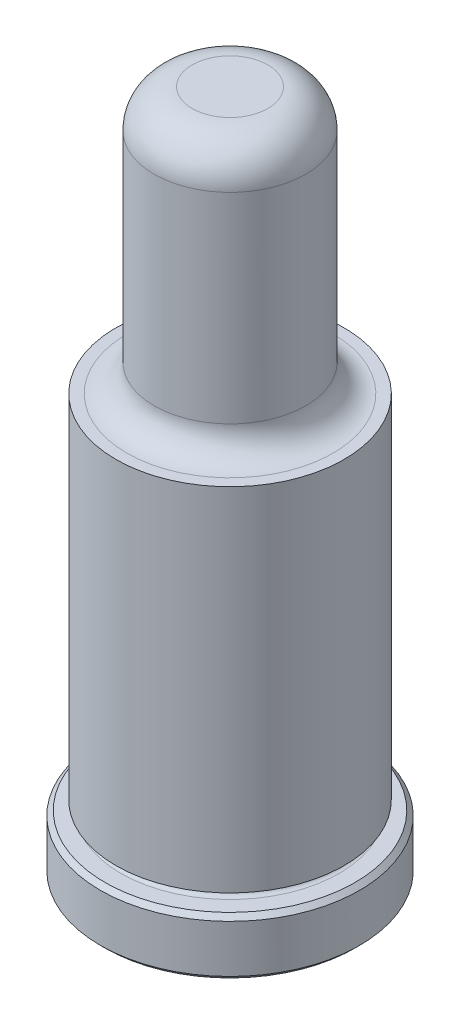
ISO-10303-21;
HEADER;
FILE_DESCRIPTION(('STEP AP214'),'2;1');
FILE_NAME('part.step','',(''),(''),'','','');
FILE_SCHEMA(('AUTOMOTIVE_DESIGN { 1 0 10303 214 1 1 1 1 }'));
ENDSEC;
DATA;
#1=APPLICATION_CONTEXT('core data for automotive mechanical design processes');
#2=APPLICATION_PROTOCOL_DEFINITION('international standard','automotive_design',2000,#1);
#3=PRODUCT_CONTEXT('',#1,'mechanical');
#4=PRODUCT('Part','Part','',(#3));
#5=PRODUCT_RELATED_PRODUCT_CATEGORY('part','',(#4));
#6=PRODUCT_DEFINITION_FORMATION('','',#4);
#7=PRODUCT_DEFINITION_CONTEXT('part definition',#1,'design');
#8=PRODUCT_DEFINITION('design','',#6,#7);
#9=PRODUCT_DEFINITION_SHAPE('','',#8);
#10=(LENGTH_UNIT() NAMED_UNIT(*) SI_UNIT(.MILLI.,.METRE.));
#11=(NAMED_UNIT(*) PLANE_ANGLE_UNIT() SI_UNIT($,.RADIAN.));
#12=(NAMED_UNIT(*) SI_UNIT($,.STERADIAN.) SOLID_ANGLE_UNIT());
#13=UNCERTAINTY_MEASURE_WITH_UNIT(LENGTH_MEASURE(1.E-05),#10,'distance_accuracy_value','');
#14=(GEOMETRIC_REPRESENTATION_CONTEXT(3) GLOBAL_UNCERTAINTY_ASSIGNED_CONTEXT((#13)) GLOBAL_UNIT_ASSIGNED_CONTEXT((#10,
#11,#12)) REPRESENTATION_CONTEXT('',''));
#15=CARTESIAN_POINT('',(0.,0.,0.));
#16=DIRECTION('',(0.,0.,1.));
#17=DIRECTION('',(1.,0.,0.));
#18=AXIS2_PLACEMENT_3D('',#15,#16,#17);
#19=CARTESIAN_POINT('',(0.,0.,0.));
#20=DIRECTION('',(0.,1.,0.));
#21=DIRECTION('',(0.,0.,1.));
#22=AXIS2_PLACEMENT_3D('',#19,#20,#21);
#23=PLANE('',#22);
#24=CARTESIAN_POINT('',(0.,0.,0.));
#25=DIRECTION('',(0.,1.,0.));
#26=DIRECTION('',(0.,0.,1.));
#27=AXIS2_PLACEMENT_3D('',#24,#25,#26);
#28=CIRCLE('',#27,10.4521);
#29=CARTESIAN_POINT('',(0.,0.,10.4521));
#30=VERTEX_POINT('',#29);
#31=EDGE_CURVE('E46',#30,#30,#28,.F.);
#32=ORIENTED_EDGE('',*,*,#31,.T.);
#33=EDGE_LOOP('',(#32));
#34=FACE_BOUND('',#33,.T.);
#35=ADVANCED_FACE('F31',(#34),#23,.F.);
#36=CARTESIAN_POINT('',(0.,0.,0.));
#37=DIRECTION('',(0.,1.,0.));
#38=DIRECTION('',(0.,0.,1.));
#39=AXIS2_PLACEMENT_3D('',#36,#37,#38);
#40=CYLINDRICAL_SURFACE('',#39,10.8331);
#41=CARTESIAN_POINT('',(0.,0.381000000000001,0.));
#42=DIRECTION('',(0.,1.,0.));
#43=DIRECTION('',(0.,0.,1.));
#44=AXIS2_PLACEMENT_3D('',#41,#42,#43);
#45=CIRCLE('',#44,10.8331);
#46=CARTESIAN_POINT('',(0.,0.380999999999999,10.8331));
#47=VERTEX_POINT('',#46);
#48=EDGE_CURVE('E51',#47,#47,#45,.T.);
#49=ORIENTED_EDGE('',*,*,#48,.T.);
#50=EDGE_LOOP('',(#49));
#51=FACE_BOUND('',#50,.T.);
#52=CARTESIAN_POINT('',(0.,4.3688,0.));
#53=DIRECTION('',(0.,-1.,0.));
#54=DIRECTION('',(0.,0.,-1.));
#55=AXIS2_PLACEMENT_3D('',#52,#53,#54);
#56=CIRCLE('',#55,10.8331);
#57=CARTESIAN_POINT('',(0.,4.36880000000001,-10.8331));
#58=VERTEX_POINT('',#57);
#59=EDGE_CURVE('E54',#58,#58,#56,.T.);
#60=ORIENTED_EDGE('',*,*,#59,.T.);
#61=EDGE_LOOP('',(#60));
#62=FACE_BOUND('',#61,.T.);
#63=ADVANCED_FACE('F110',(#51,#62),#40,.T.);
#64=CARTESIAN_POINT('',(0.,4.7498,-10.8331));
#65=DIRECTION('',(0.,-1.,0.));
#66=DIRECTION('',(0.,0.,-1.));
#67=AXIS2_PLACEMENT_3D('',#64,#65,#66);
#68=PLANE('',#67);
#69=CARTESIAN_POINT('',(0.,4.7498,0.));
#70=DIRECTION('',(0.,-1.,0.));
#71=DIRECTION('',(0.,0.,-1.));
#72=AXIS2_PLACEMENT_3D('',#69,#70,#71);
#73=CIRCLE('',#72,10.4521);
#74=CARTESIAN_POINT('',(0.,4.7498,-10.4521));
#75=VERTEX_POINT('',#74);
#76=EDGE_CURVE('E42',#75,#75,#73,.F.);
#77=ORIENTED_EDGE('',*,*,#76,.T.);
#78=EDGE_LOOP('',(#77));
#79=FACE_BOUND('',#78,.T.);
#80=CARTESIAN_POINT('',(0.,4.7498,0.));
#81=DIRECTION('',(0.,1.,0.));
#82=DIRECTION('',(0.,0.,1.));
#83=AXIS2_PLACEMENT_3D('',#80,#81,#82);
#84=CIRCLE('',#83,9.13129999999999);
#85=CARTESIAN_POINT('',(0.,4.7498,9.13129999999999));
#86=VERTEX_POINT('',#85);
#87=EDGE_CURVE('E57',#86,#86,#84,.T.);
#88=ORIENTED_EDGE('',*,*,#87,.F.);
#89=EDGE_LOOP('',(#88));
#90=FACE_BOUND('',#89,.T.);
#91=ADVANCED_FACE('F105',(#79,#90),#68,.F.);
#92=CARTESIAN_POINT('',(0.,5.1308,0.));
#93=DIRECTION('',(0.,1.,0.));
#94=DIRECTION('',(0.,0.,1.));
#95=AXIS2_PLACEMENT_3D('',#92,#93,#94);
#96=TOROIDAL_SURFACE('',#95,9.13129999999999,0.381);
#97=CARTESIAN_POINT('',(0.,5.5118,0.));
#98=DIRECTION('',(0.,1.,0.));
#99=DIRECTION('',(0.,0.,1.));
#100=AXIS2_PLACEMENT_3D('',#97,#98,#99);
#101=CIRCLE('',#100,9.13129999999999);
#102=CARTESIAN_POINT('',(0.,5.5118,9.13129999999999));
#103=VERTEX_POINT('',#102);
#104=EDGE_CURVE('E60',#103,#103,#101,.T.);
#105=ORIENTED_EDGE('',*,*,#104,.F.);
#106=EDGE_LOOP('',(#105));
#107=FACE_BOUND('',#106,.T.);
#108=ORIENTED_EDGE('',*,*,#87,.T.);
#109=EDGE_LOOP('',(#108));
#110=FACE_BOUND('',#109,.T.);
#111=ADVANCED_FACE('F99',(#107,#110),#96,.F.);
#112=CARTESIAN_POINT('',(0.,5.5118,-9.13129999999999));
#113=DIRECTION('',(0.,1.,0.));
#114=DIRECTION('',(0.,0.,1.));
#115=AXIS2_PLACEMENT_3D('',#112,#113,#114);
#116=PLANE('',#115);
#117=CARTESIAN_POINT('',(0.,5.5118,0.));
#118=DIRECTION('',(0.,1.,0.));
#119=DIRECTION('',(0.,0.,1.));
#120=AXIS2_PLACEMENT_3D('',#117,#118,#119);
#121=CIRCLE('',#120,9.53769999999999);
#122=CARTESIAN_POINT('',(0.,5.5118,9.53769999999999));
#123=VERTEX_POINT('',#122);
#124=EDGE_CURVE('E63',#123,#123,#121,.T.);
#125=ORIENTED_EDGE('',*,*,#124,.F.);
#126=EDGE_LOOP('',(#125));
#127=FACE_BOUND('',#126,.T.);
#128=ORIENTED_EDGE('',*,*,#104,.T.);
#129=EDGE_LOOP('',(#128));
#130=FACE_BOUND('',#129,.T.);
#131=ADVANCED_FACE('F93',(#127,#130),#116,.F.);
#132=CARTESIAN_POINT('',(0.,0.,0.));
#133=DIRECTION('',(0.,1.,0.));
#134=DIRECTION('',(0.,0.,1.));
#135=AXIS2_PLACEMENT_3D('',#132,#133,#134);
#136=CYLINDRICAL_SURFACE('',#135,9.53769999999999);
#137=CARTESIAN_POINT('',(0.,34.925,0.));
#138=DIRECTION('',(0.,1.,0.));
#139=DIRECTION('',(0.,0.,1.));
#140=AXIS2_PLACEMENT_3D('',#137,#138,#139);
#141=CIRCLE('',#140,9.53769999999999);
#142=CARTESIAN_POINT('',(0.,34.925,9.5377));
#143=VERTEX_POINT('',#142);
#144=EDGE_CURVE('E66',#143,#143,#141,.T.);
#145=ORIENTED_EDGE('',*,*,#144,.F.);
#146=EDGE_LOOP('',(#145));
#147=FACE_BOUND('',#146,.T.);
#148=ORIENTED_EDGE('',*,*,#124,.T.);
#149=EDGE_LOOP('',(#148));
#150=FACE_BOUND('',#149,.T.);
#151=ADVANCED_FACE('F87',(#147,#150),#136,.T.);
#152=CARTESIAN_POINT('',(0.,34.925,-9.53769999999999));
#153=DIRECTION('',(0.,-1.,0.));
#154=DIRECTION('',(0.,0.,-1.));
#155=AXIS2_PLACEMENT_3D('',#152,#153,#154);
#156=PLANE('',#155);
#157=CARTESIAN_POINT('',(0.,34.925,0.));
#158=DIRECTION('',(0.,1.,0.));
#159=DIRECTION('',(0.,0.,1.));
#160=AXIS2_PLACEMENT_3D('',#157,#158,#159);
#161=CIRCLE('',#160,8.62329999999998);
#162=CARTESIAN_POINT('',(0.,34.925,8.62329999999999));
#163=VERTEX_POINT('',#162);
#164=EDGE_CURVE('E69',#163,#163,#161,.T.);
#165=ORIENTED_EDGE('',*,*,#164,.F.);
#166=EDGE_LOOP('',(#165));
#167=FACE_BOUND('',#166,.T.);
#168=ORIENTED_EDGE('',*,*,#144,.T.);
#169=EDGE_LOOP('',(#168));
#170=FACE_BOUND('',#169,.T.);
#171=ADVANCED_FACE('F81',(#167,#170),#156,.F.);
#172=CARTESIAN_POINT('',(0.,37.211,0.));
#173=DIRECTION('',(0.,1.,0.));
#174=DIRECTION('',(0.,0.,1.));
#175=AXIS2_PLACEMENT_3D('',#172,#173,#174);
#176=TOROIDAL_SURFACE('',#175,8.62329999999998,2.286);
#177=CARTESIAN_POINT('',(0.,37.211,0.));
#178=DIRECTION('',(0.,1.,0.));
#179=DIRECTION('',(0.,0.,1.));
#180=AXIS2_PLACEMENT_3D('',#177,#178,#179);
#181=CIRCLE('',#180,6.33729999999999);
#182=CARTESIAN_POINT('',(0.,37.211,6.33729999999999));
#183=VERTEX_POINT('',#182);
#184=EDGE_CURVE('E72',#183,#183,#181,.T.);
#185=ORIENTED_EDGE('',*,*,#184,.F.);
#186=EDGE_LOOP('',(#185));
#187=FACE_BOUND('',#186,.T.);
#188=ORIENTED_EDGE('',*,*,#164,.T.);
#189=EDGE_LOOP('',(#188));
#190=FACE_BOUND('',#189,.T.);
#191=ADVANCED_FACE('F78',(#187,#190),#176,.F.);
#192=CARTESIAN_POINT('',(0.,0.,0.));
#193=DIRECTION('',(0.,1.,0.));
#194=DIRECTION('',(0.,0.,1.));
#195=AXIS2_PLACEMENT_3D('',#192,#193,#194);
#196=CYLINDRICAL_SURFACE('',#195,6.33729999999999);
#197=CARTESIAN_POINT('',(0.,53.975,0.));
#198=DIRECTION('',(0.,-1.,0.));
#199=DIRECTION('',(0.,0.,-1.));
#200=AXIS2_PLACEMENT_3D('',#197,#198,#199);
#201=CIRCLE('',#200,6.33729999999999);
#202=CARTESIAN_POINT('',(0.,53.975,-6.33729999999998));
#203=VERTEX_POINT('',#202);
#204=EDGE_CURVE('E10',#203,#203,#201,.T.);
#205=ORIENTED_EDGE('',*,*,#204,.T.);
#206=EDGE_LOOP('',(#205));
#207=FACE_BOUND('',#206,.T.);
#208=ORIENTED_EDGE('',*,*,#184,.T.);
#209=EDGE_LOOP('',(#208));
#210=FACE_BOUND('',#209,.T.);
#211=ADVANCED_FACE('F76',(#207,#210),#196,.T.);
#212=CARTESIAN_POINT('',(0.,57.15,-6.33729999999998));
#213=DIRECTION('',(0.,-1.,0.));
#214=DIRECTION('',(0.,0.,-1.));
#215=AXIS2_PLACEMENT_3D('',#212,#213,#214);
#216=PLANE('',#215);
#217=CARTESIAN_POINT('',(0.,57.15,0.));
#218=DIRECTION('',(0.,-1.,0.));
#219=DIRECTION('',(0.,0.,-1.));
#220=AXIS2_PLACEMENT_3D('',#217,#218,#219);
#221=CIRCLE('',#220,3.16229999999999);
#222=CARTESIAN_POINT('',(0.,57.15,-3.16229999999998));
#223=VERTEX_POINT('',#222);
#224=EDGE_CURVE('E38',#223,#223,#221,.F.);
#225=ORIENTED_EDGE('',*,*,#224,.T.);
#226=EDGE_LOOP('',(#225));
#227=FACE_BOUND('',#226,.T.);
#228=ADVANCED_FACE('F127',(#227),#216,.F.);
#229=CARTESIAN_POINT('',(0.,0.381000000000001,0.));
#230=DIRECTION('',(0.,1.,0.));
#231=DIRECTION('',(0.,0.,1.));
#232=AXIS2_PLACEMENT_3D('',#229,#230,#231);
#233=CONICAL_SURFACE('',#232,10.8331,0.785398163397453);
#234=ORIENTED_EDGE('',*,*,#31,.F.);
#235=EDGE_LOOP('',(#234));
#236=FACE_BOUND('',#235,.T.);
#237=ORIENTED_EDGE('',*,*,#48,.F.);
#238=EDGE_LOOP('',(#237));
#239=FACE_BOUND('',#238,.T.);
#240=ADVANCED_FACE('F124',(#236,#239),#233,.T.);
#241=CARTESIAN_POINT('',(0.,4.7498,0.));
#242=DIRECTION('',(0.,-1.,0.));
#243=DIRECTION('',(0.,0.,-1.));
#244=AXIS2_PLACEMENT_3D('',#241,#242,#243);
#245=CONICAL_SURFACE('',#244,10.4521,0.785398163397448);
#246=CARTESIAN_POINT('',(0.,4.36880000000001,-10.8331));
#247=CARTESIAN_POINT('',(0.,4.37276875,-10.82913125));
#248=CARTESIAN_POINT('',(0.,4.3767375,-10.8251625));
#249=CARTESIAN_POINT('',(0.,4.384675,-10.817225));
#250=CARTESIAN_POINT('',(0.,4.38864375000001,-10.81325625));
#251=CARTESIAN_POINT('',(0.,4.39658125,-10.80531875));
#252=CARTESIAN_POINT('',(0.,4.40055,-10.80135));
#253=CARTESIAN_POINT('',(0.,4.4084875,-10.7934125));
#254=CARTESIAN_POINT('',(0.,4.41245625,-10.78944375));
#255=CARTESIAN_POINT('',(0.,4.42039375,-10.78150625));
#256=CARTESIAN_POINT('',(0.,4.4243625,-10.7775375));
#257=CARTESIAN_POINT('',(0.,4.4323,-10.7696));
#258=CARTESIAN_POINT('',(0.,4.43626875,-10.76563125));
#259=CARTESIAN_POINT('',(0.,4.44420625,-10.75769375));
#260=CARTESIAN_POINT('',(0.,4.448175,-10.753725));
#261=CARTESIAN_POINT('',(0.,4.4561125,-10.7457875));
#262=CARTESIAN_POINT('',(0.,4.46008125,-10.74181875));
#263=CARTESIAN_POINT('',(0.,4.46801875,-10.73388125));
#264=CARTESIAN_POINT('',(0.,4.4719875,-10.7299125));
#265=CARTESIAN_POINT('',(0.,4.479925,-10.721975));
#266=CARTESIAN_POINT('',(0.,4.48389375,-10.71800625));
#267=CARTESIAN_POINT('',(0.,4.49183125,-10.71006875));
#268=CARTESIAN_POINT('',(0.,4.4958,-10.7061));
#269=CARTESIAN_POINT('',(0.,4.5037375,-10.6981625));
#270=CARTESIAN_POINT('',(0.,4.50770625,-10.69419375));
#271=CARTESIAN_POINT('',(0.,4.51564375,-10.68625625));
#272=CARTESIAN_POINT('',(0.,4.5196125,-10.6822875));
#273=CARTESIAN_POINT('',(0.,4.52755,-10.67435));
#274=CARTESIAN_POINT('',(0.,4.53151875,-10.67038125));
#275=CARTESIAN_POINT('',(0.,4.53945625,-10.66244375));
#276=CARTESIAN_POINT('',(0.,4.543425,-10.658475));
#277=CARTESIAN_POINT('',(0.,4.5513625,-10.6505375));
#278=CARTESIAN_POINT('',(0.,4.55533125,-10.64656875));
#279=CARTESIAN_POINT('',(0.,4.56326875,-10.63863125));
#280=CARTESIAN_POINT('',(0.,4.5672375,-10.6346625));
#281=CARTESIAN_POINT('',(0.,4.575175,-10.626725));
#282=CARTESIAN_POINT('',(0.,4.57914375,-10.62275625));
#283=CARTESIAN_POINT('',(0.,4.58708125,-10.61481875));
#284=CARTESIAN_POINT('',(0.,4.59105,-10.61085));
#285=CARTESIAN_POINT('',(0.,4.5989875,-10.6029125));
#286=CARTESIAN_POINT('',(0.,4.60295625,-10.59894375));
#287=CARTESIAN_POINT('',(0.,4.61089375,-10.59100625));
#288=CARTESIAN_POINT('',(0.,4.6148625,-10.5870375));
#289=CARTESIAN_POINT('',(0.,4.6228,-10.5791));
#290=CARTESIAN_POINT('',(0.,4.62676875,-10.57513125));
#291=CARTESIAN_POINT('',(0.,4.63470625,-10.56719375));
#292=CARTESIAN_POINT('',(0.,4.638675,-10.563225));
#293=CARTESIAN_POINT('',(0.,4.6466125,-10.5552875));
#294=CARTESIAN_POINT('',(0.,4.65058125,-10.55131875));
#295=CARTESIAN_POINT('',(0.,4.65851875,-10.54338125));
#296=CARTESIAN_POINT('',(0.,4.6624875,-10.5394125));
#297=CARTESIAN_POINT('',(0.,4.670425,-10.531475));
#298=CARTESIAN_POINT('',(0.,4.67439375,-10.52750625));
#299=CARTESIAN_POINT('',(0.,4.68233125,-10.51956875));
#300=CARTESIAN_POINT('',(0.,4.6863,-10.5156));
#301=CARTESIAN_POINT('',(0.,4.6942375,-10.5076625));
#302=CARTESIAN_POINT('',(0.,4.69820625,-10.50369375));
#303=CARTESIAN_POINT('',(0.,4.70614375,-10.49575625));
#304=CARTESIAN_POINT('',(0.,4.7101125,-10.4917875));
#305=CARTESIAN_POINT('',(0.,4.71805,-10.48385));
#306=CARTESIAN_POINT('',(0.,4.72201875,-10.47988125));
#307=CARTESIAN_POINT('',(0.,4.72995625,-10.47194375));
#308=CARTESIAN_POINT('',(0.,4.733925,-10.467975));
#309=CARTESIAN_POINT('',(0.,4.7418625,-10.4600375));
#310=CARTESIAN_POINT('',(0.,4.74583125,-10.45606875));
#311=CARTESIAN_POINT('',(0.,4.7498,-10.4521));
#312=B_SPLINE_CURVE_WITH_KNOTS('',3,(#246,#247,#248,#249,#250,#251,#252,#253,#254,#255,#256,
#257,#258,#259,#260,#261,#262,#263,#264,#265,#266,#267,#268,#269,#270,#271,#272,#273,#274,#275,
#276,#277,#278,#279,#280,#281,#282,#283,#284,#285,#286,#287,#288,#289,#290,#291,#292,#293,#294,
#295,#296,#297,#298,#299,#300,#301,#302,#303,#304,#305,#306,#307,#308,#309,#310,#311),
.UNSPECIFIED.,.F.,.F.,(4,2,2,2,2,2,2,2,2,2,2,2,2,2,2,2,2,2,2,2,2,2,2,2,2,2,2,2,2,2,2,2,4),(0.,
0.0168379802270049,0.0336759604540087,0.0505139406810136,0.0673519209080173,0.0841899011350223,
0.101027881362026,0.117865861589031,0.134703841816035,0.15154182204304,0.168379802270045,
0.185217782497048,0.202055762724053,0.218893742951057,0.235731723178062,0.252569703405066,
0.269407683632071,0.286245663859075,0.30308364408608,0.319921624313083,0.336759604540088,
0.353597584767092,0.370435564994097,0.387273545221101,0.404111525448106,0.420949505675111,
0.437787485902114,0.454625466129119,0.471463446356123,0.488301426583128,0.505139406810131,
0.521977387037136,0.53881536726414),.UNSPECIFIED.);
#313=EDGE_CURVE('BSEAM126',#58,#75,#312,.T.);
#314=ORIENTED_EDGE('',*,*,#59,.F.);
#315=ORIENTED_EDGE('',*,*,#76,.F.);
#316=ORIENTED_EDGE('',*,*,#313,.T.);
#317=ORIENTED_EDGE('',*,*,#313,.F.);
#318=EDGE_LOOP('',(#314,#316,#315,#317));
#319=FACE_BOUND('',#318,.T.);
#320=ADVANCED_FACE('F126',(#319),#245,.T.);
#321=CARTESIAN_POINT('',(0.,53.975,0.));
#322=DIRECTION('',(0.,-1.,0.));
#323=DIRECTION('',(0.,0.,-1.));
#324=AXIS2_PLACEMENT_3D('',#321,#322,#323);
#325=DEGENERATE_TOROIDAL_SURFACE('',#324,3.16229999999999,3.175,.T.);
#326=ORIENTED_EDGE('',*,*,#204,.F.);
#327=EDGE_LOOP('',(#326));
#328=FACE_BOUND('',#327,.T.);
#329=ORIENTED_EDGE('',*,*,#224,.F.);
#330=EDGE_LOOP('',(#329));
#331=FACE_BOUND('',#330,.T.);
#332=ADVANCED_FACE('F33',(#328,#331),#325,.T.);
#333=CLOSED_SHELL('',(#35,#63,#91,#111,#131,#151,#171,#191,#211,#228,#240,#320,#332));
#334=MANIFOLD_SOLID_BREP('B2',#333);
#335=ADVANCED_BREP_SHAPE_REPRESENTATION('',(#18,#334),#14);
#336=SHAPE_DEFINITION_REPRESENTATION(#9,#335);
ENDSEC;
END-ISO-10303-21;
